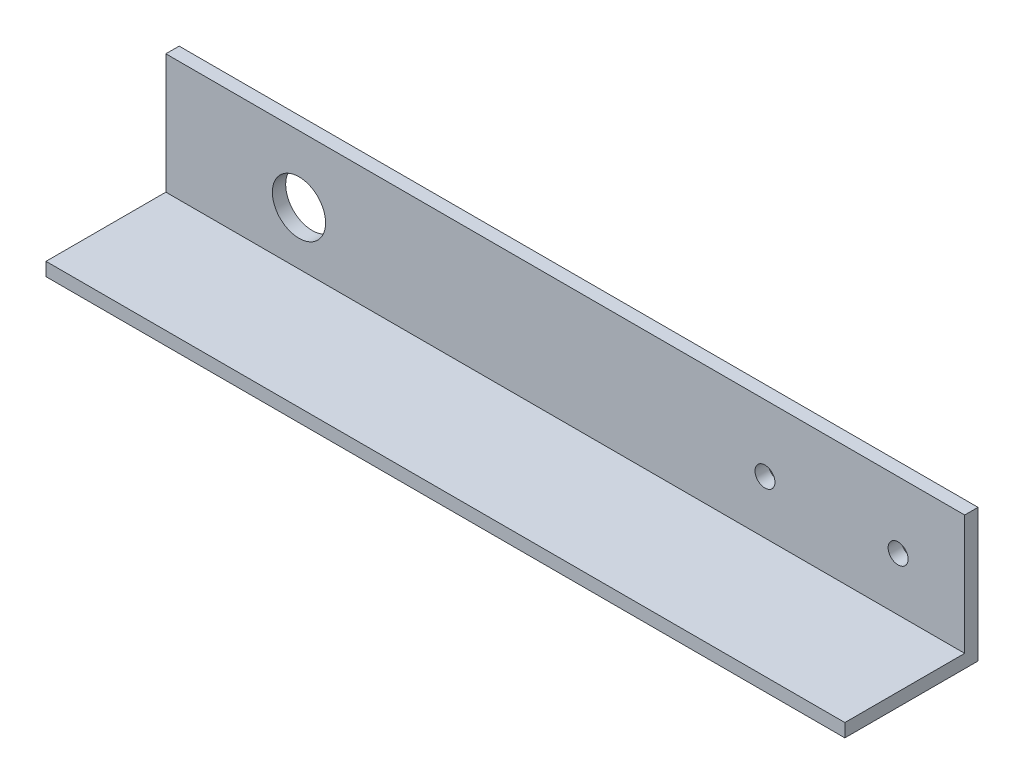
from build123d import *

# Parameters (mm, degrees)
EXTRUDE_1_DEPTH     = 120
SKETCH_3_R          = 4
CUT_EXTRUDE_2_DEPTH = 124.288280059
SKETCH_4_R          = 1.5
CUT_EXTRUDE_3_DEPTH = 124.288280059
SKETCH_5_R          = 1.5
CUT_EXTRUDE_4_DEPTH = 124.288280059


with BuildPart() as part:
    # Sketch 1 → Extrude 1 (new body)
    with BuildSketch(Plane(origin=(0, 0, 0), x_dir=(0, 0, -1), z_dir=(1, 0, 0))):
        Polygon((0, 0), (0, 20), (-2, 20), (-2, 2), (-20, 2), (-20, 0), align=None)
    extrude(amount=EXTRUDE_1_DEPTH)

    # Sketch 3 → Cut-Extrude 2 (cut, through all)
    with BuildSketch(Plane(origin=(0, 0, 0), x_dir=(-1, 0, 0), z_dir=(0, 0, -1))):
        with Locations((-20, 10)):
            Circle(SKETCH_3_R)
    extrude(amount=-CUT_EXTRUDE_2_DEPTH, mode=Mode.SUBTRACT)

    # Sketch 4 → Cut-Extrude 3 (cut, through all)
    with BuildSketch(Plane(origin=(0, 0, 0), x_dir=(-1, 0, 0), z_dir=(0, 0, -1))):
        with Locations((-90, 10)):
            Circle(SKETCH_4_R)
    extrude(amount=-CUT_EXTRUDE_3_DEPTH, mode=Mode.SUBTRACT)

    # Sketch 5 → Cut-Extrude 4 (cut, through all)
    with BuildSketch(Plane(origin=(0, 0, 0), x_dir=(-1, 0, 0), z_dir=(0, 0, -1))):
        with Locations((-110, 10)):
            Circle(SKETCH_5_R)
    extrude(amount=-CUT_EXTRUDE_4_DEPTH, mode=Mode.SUBTRACT)


solid = part.part
